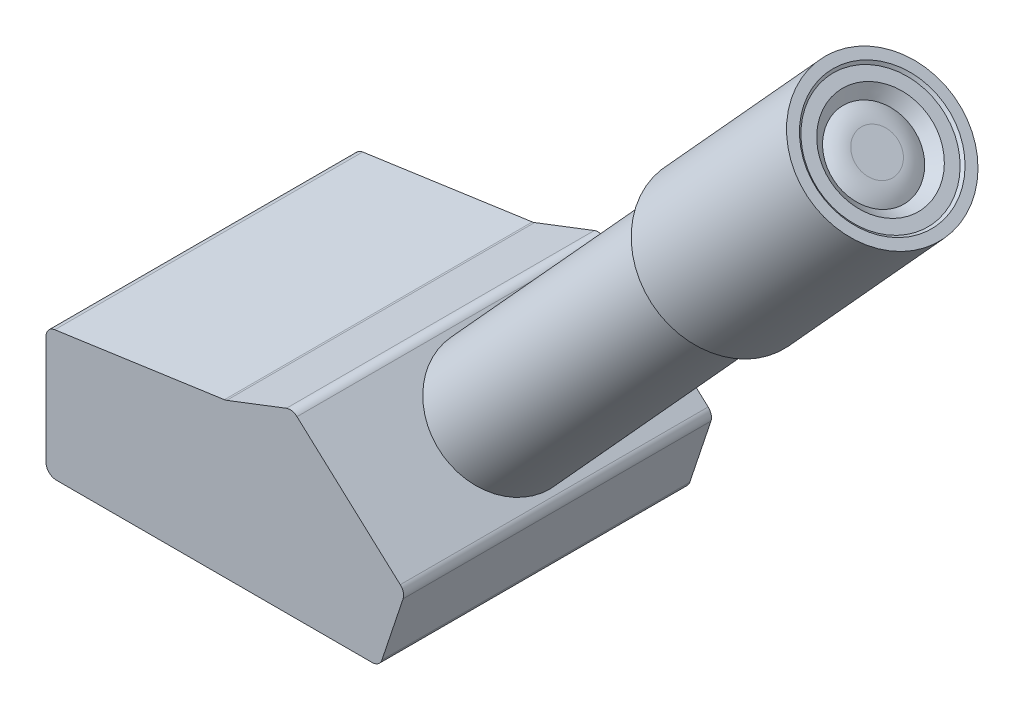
ISO-10303-21;
HEADER;
FILE_DESCRIPTION(('STEP AP214'),'2;1');
FILE_NAME('part.step','',(''),(''),'','','');
FILE_SCHEMA(('AUTOMOTIVE_DESIGN { 1 0 10303 214 1 1 1 1 }'));
ENDSEC;
DATA;
#1=APPLICATION_CONTEXT('core data for automotive mechanical design processes');
#2=APPLICATION_PROTOCOL_DEFINITION('international standard','automotive_design',2000,#1);
#3=PRODUCT_CONTEXT('',#1,'mechanical');
#4=PRODUCT('Part','Part','',(#3));
#5=PRODUCT_RELATED_PRODUCT_CATEGORY('part','',(#4));
#6=PRODUCT_DEFINITION_FORMATION('','',#4);
#7=PRODUCT_DEFINITION_CONTEXT('part definition',#1,'design');
#8=PRODUCT_DEFINITION('design','',#6,#7);
#9=PRODUCT_DEFINITION_SHAPE('','',#8);
#10=(LENGTH_UNIT() NAMED_UNIT(*) SI_UNIT(.MILLI.,.METRE.));
#11=(NAMED_UNIT(*) PLANE_ANGLE_UNIT() SI_UNIT($,.RADIAN.));
#12=(NAMED_UNIT(*) SI_UNIT($,.STERADIAN.) SOLID_ANGLE_UNIT());
#13=UNCERTAINTY_MEASURE_WITH_UNIT(LENGTH_MEASURE(1.E-05),#10,'distance_accuracy_value','');
#14=(GEOMETRIC_REPRESENTATION_CONTEXT(3) GLOBAL_UNCERTAINTY_ASSIGNED_CONTEXT((#13)) GLOBAL_UNIT_ASSIGNED_CONTEXT((#10,
#11,#12)) REPRESENTATION_CONTEXT('',''));
#15=CARTESIAN_POINT('',(0.,0.,0.));
#16=DIRECTION('',(0.,0.,1.));
#17=DIRECTION('',(1.,0.,0.));
#18=AXIS2_PLACEMENT_3D('',#15,#16,#17);
#19=CARTESIAN_POINT('',(2.00000000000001,0.,60.));
#20=DIRECTION('',(0.,1.,0.));
#21=DIRECTION('',(0.,0.,1.));
#22=AXIS2_PLACEMENT_3D('',#19,#20,#21);
#23=PLANE('',#22);
#24=DIRECTION('',(1.,0.,0.));
#25=VECTOR('',#24,1.);
#26=CARTESIAN_POINT('',(2.00000000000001,0.,0.));
#27=LINE('',#26,#25);
#28=CARTESIAN_POINT('',(2.00000000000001,0.,0.));
#29=VERTEX_POINT('',#28);
#30=CARTESIAN_POINT('',(63.5584815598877,0.,0.));
#31=VERTEX_POINT('',#30);
#32=EDGE_CURVE('E147',#29,#31,#27,.T.);
#33=ORIENTED_EDGE('',*,*,#32,.T.);
#34=DIRECTION('',(0.,0.,-1.));
#35=VECTOR('',#34,1.);
#36=CARTESIAN_POINT('',(63.5584815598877,0.,60.));
#37=LINE('',#36,#35);
#38=CARTESIAN_POINT('',(63.5584815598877,0.,60.));
#39=VERTEX_POINT('',#38);
#40=EDGE_CURVE('E208',#39,#31,#37,.T.);
#41=ORIENTED_EDGE('',*,*,#40,.F.);
#42=DIRECTION('',(1.,0.,0.));
#43=VECTOR('',#42,1.);
#44=CARTESIAN_POINT('',(2.00000000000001,0.,60.));
#45=LINE('',#44,#43);
#46=CARTESIAN_POINT('',(2.00000000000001,0.,60.));
#47=VERTEX_POINT('',#46);
#48=EDGE_CURVE('E170',#47,#39,#45,.T.);
#49=ORIENTED_EDGE('',*,*,#48,.F.);
#50=DIRECTION('',(0.,0.,-1.));
#51=VECTOR('',#50,1.);
#52=CARTESIAN_POINT('',(2.00000000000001,0.,60.));
#53=LINE('',#52,#51);
#54=EDGE_CURVE('E211',#47,#29,#53,.T.);
#55=ORIENTED_EDGE('',*,*,#54,.T.);
#56=EDGE_LOOP('',(#33,#41,#49,#55));
#57=FACE_BOUND('',#56,.T.);
#58=CARTESIAN_POINT('',(40.,0.,30.));
#59=DIRECTION('',(0.,1.,0.));
#60=DIRECTION('',(0.,0.,1.));
#61=AXIS2_PLACEMENT_3D('',#58,#59,#60);
#62=CIRCLE('',#61,10.);
#63=CARTESIAN_POINT('',(40.,0.,40.));
#64=VERTEX_POINT('',#63);
#65=EDGE_CURVE('E11',#64,#64,#62,.F.);
#66=ORIENTED_EDGE('',*,*,#65,.F.);
#67=EDGE_LOOP('',(#66));
#68=FACE_BOUND('',#67,.T.);
#69=ADVANCED_FACE('F27',(#57,#68),#23,.F.);
#70=CARTESIAN_POINT('',(69.0359910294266,15.8763717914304,60.));
#71=DIRECTION('',(-0.672672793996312,-0.739940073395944,0.));
#72=DIRECTION('',(0.739940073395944,-0.672672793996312,0.));
#73=AXIS2_PLACEMENT_3D('',#70,#71,#72);
#74=PLANE('',#73);
#75=DIRECTION('',(-0.739940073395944,0.672672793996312,0.));
#76=VECTOR('',#75,1.);
#77=CARTESIAN_POINT('',(69.0359910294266,15.8763717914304,0.));
#78=LINE('',#77,#76);
#79=CARTESIAN_POINT('',(69.0359910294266,15.8763717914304,0.));
#80=VERTEX_POINT('',#79);
#81=CARTESIAN_POINT('',(48.9124091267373,34.1705371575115,0.));
#82=VERTEX_POINT('',#81);
#83=EDGE_CURVE('E155',#80,#82,#78,.T.);
#84=ORIENTED_EDGE('',*,*,#83,.T.);
#85=DIRECTION('',(0.,0.,-1.));
#86=VECTOR('',#85,1.);
#87=CARTESIAN_POINT('',(48.9124091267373,34.1705371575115,60.));
#88=LINE('',#87,#86);
#89=CARTESIAN_POINT('',(48.9124091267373,34.1705371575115,60.));
#90=VERTEX_POINT('',#89);
#91=EDGE_CURVE('E196',#90,#82,#88,.T.);
#92=ORIENTED_EDGE('',*,*,#91,.F.);
#93=DIRECTION('',(-0.739940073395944,0.672672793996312,0.));
#94=VECTOR('',#93,1.);
#95=CARTESIAN_POINT('',(69.0359910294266,15.8763717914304,60.));
#96=LINE('',#95,#94);
#97=CARTESIAN_POINT('',(69.0359910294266,15.8763717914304,60.));
#98=VERTEX_POINT('',#97);
#99=EDGE_CURVE('E178',#98,#90,#96,.T.);
#100=ORIENTED_EDGE('',*,*,#99,.F.);
#101=DIRECTION('',(0.,0.,-1.));
#102=VECTOR('',#101,1.);
#103=CARTESIAN_POINT('',(69.0359910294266,15.8763717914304,60.));
#104=LINE('',#103,#102);
#105=EDGE_CURVE('E199',#98,#80,#104,.T.);
#106=ORIENTED_EDGE('',*,*,#105,.T.);
#107=EDGE_LOOP('',(#84,#92,#100,#106));
#108=FACE_BOUND('',#107,.T.);
#109=CARTESIAN_POINT('',(58.974200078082,25.023454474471,30.));
#110=DIRECTION('',(-0.672672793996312,-0.739940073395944,0.));
#111=DIRECTION('',(0.739940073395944,-0.672672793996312,0.));
#112=AXIS2_PLACEMENT_3D('',#109,#110,#111);
#113=CIRCLE('',#112,12.5);
#114=CARTESIAN_POINT('',(68.2234509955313,16.6150445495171,30.));
#115=VERTEX_POINT('',#114);
#116=EDGE_CURVE('E134',#115,#115,#113,.F.);
#117=ORIENTED_EDGE('',*,*,#116,.F.);
#118=EDGE_LOOP('',(#117));
#119=FACE_BOUND('',#118,.T.);
#120=ADVANCED_FACE('F237',(#108,#119),#74,.F.);
#121=CARTESIAN_POINT('',(2.,23.2654091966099,60.));
#122=DIRECTION('',(0.,0.,-1.));
#123=DIRECTION('',(-1.,0.,0.));
#124=AXIS2_PLACEMENT_3D('',#121,#122,#123);
#125=CYLINDRICAL_SURFACE('',#124,2.);
#126=CARTESIAN_POINT('',(2.,23.2654091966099,0.));
#127=DIRECTION('',(0.,0.,1.));
#128=DIRECTION('',(1.,0.,0.));
#129=AXIS2_PLACEMENT_3D('',#126,#127,#128);
#130=CIRCLE('',#129,2.);
#131=CARTESIAN_POINT('',(1.71715728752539,25.2453081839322,0.));
#132=VERTEX_POINT('',#131);
#133=CARTESIAN_POINT('',(0.,23.2654091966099,0.));
#134=VERTEX_POINT('',#133);
#135=EDGE_CURVE('E121',#132,#134,#130,.T.);
#136=ORIENTED_EDGE('',*,*,#135,.T.);
#137=DIRECTION('',(0.,0.,-1.));
#138=VECTOR('',#137,1.);
#139=CARTESIAN_POINT('',(0.,23.2654091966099,60.));
#140=LINE('',#139,#138);
#141=CARTESIAN_POINT('',(0.,23.2654091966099,60.));
#142=VERTEX_POINT('',#141);
#143=EDGE_CURVE('E129',#142,#134,#140,.T.);
#144=ORIENTED_EDGE('',*,*,#143,.F.);
#145=CARTESIAN_POINT('',(2.,23.2654091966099,60.));
#146=DIRECTION('',(0.,0.,1.));
#147=DIRECTION('',(1.,0.,0.));
#148=AXIS2_PLACEMENT_3D('',#145,#146,#147);
#149=CIRCLE('',#148,2.);
#150=CARTESIAN_POINT('',(1.71715728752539,25.2453081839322,60.));
#151=VERTEX_POINT('',#150);
#152=EDGE_CURVE('E165',#151,#142,#149,.T.);
#153=ORIENTED_EDGE('',*,*,#152,.F.);
#154=DIRECTION('',(0.,0.,-1.));
#155=VECTOR('',#154,1.);
#156=CARTESIAN_POINT('',(1.71715728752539,25.2453081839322,60.));
#157=LINE('',#156,#155);
#158=EDGE_CURVE('E138',#151,#132,#157,.T.);
#159=ORIENTED_EDGE('',*,*,#158,.T.);
#160=EDGE_LOOP('',(#136,#144,#153,#159));
#161=FACE_BOUND('',#160,.T.);
#162=ADVANCED_FACE('F29',(#161),#125,.T.);
#163=CARTESIAN_POINT('',(0.,2.00000000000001,60.));
#164=DIRECTION('',(1.,0.,0.));
#165=DIRECTION('',(0.,0.,-1.));
#166=AXIS2_PLACEMENT_3D('',#163,#164,#165);
#167=PLANE('',#166);
#168=DIRECTION('',(0.,-1.,0.));
#169=VECTOR('',#168,1.);
#170=CARTESIAN_POINT('',(0.,2.00000000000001,0.));
#171=LINE('',#170,#169);
#172=CARTESIAN_POINT('',(0.,2.00000000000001,0.));
#173=VERTEX_POINT('',#172);
#174=EDGE_CURVE('E116',#134,#173,#171,.T.);
#175=ORIENTED_EDGE('',*,*,#174,.T.);
#176=DIRECTION('',(0.,0.,-1.));
#177=VECTOR('',#176,1.);
#178=CARTESIAN_POINT('',(0.,2.00000000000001,60.));
#179=LINE('',#178,#177);
#180=CARTESIAN_POINT('',(0.,2.00000000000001,60.));
#181=VERTEX_POINT('',#180);
#182=EDGE_CURVE('E135',#181,#173,#179,.T.);
#183=ORIENTED_EDGE('',*,*,#182,.F.);
#184=DIRECTION('',(0.,-1.,0.));
#185=VECTOR('',#184,1.);
#186=CARTESIAN_POINT('',(0.,2.00000000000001,60.));
#187=LINE('',#186,#185);
#188=EDGE_CURVE('E131',#142,#181,#187,.T.);
#189=ORIENTED_EDGE('',*,*,#188,.F.);
#190=ORIENTED_EDGE('',*,*,#143,.T.);
#191=EDGE_LOOP('',(#175,#183,#189,#190));
#192=FACE_BOUND('',#191,.T.);
#193=ADVANCED_FACE('F130',(#192),#167,.F.);
#194=CARTESIAN_POINT('',(2.,2.,60.));
#195=DIRECTION('',(0.,0.,-1.));
#196=DIRECTION('',(-1.,0.,0.));
#197=AXIS2_PLACEMENT_3D('',#194,#195,#196);
#198=CYLINDRICAL_SURFACE('',#197,2.);
#199=CARTESIAN_POINT('',(2.,2.,0.));
#200=DIRECTION('',(0.,0.,1.));
#201=DIRECTION('',(1.,0.,0.));
#202=AXIS2_PLACEMENT_3D('',#199,#200,#201);
#203=CIRCLE('',#202,2.);
#204=EDGE_CURVE('E123',#173,#29,#203,.T.);
#205=ORIENTED_EDGE('',*,*,#204,.T.);
#206=ORIENTED_EDGE('',*,*,#54,.F.);
#207=CARTESIAN_POINT('',(2.,2.,60.));
#208=DIRECTION('',(0.,0.,1.));
#209=DIRECTION('',(1.,0.,0.));
#210=AXIS2_PLACEMENT_3D('',#207,#208,#209);
#211=CIRCLE('',#210,2.);
#212=EDGE_CURVE('E168',#181,#47,#211,.T.);
#213=ORIENTED_EDGE('',*,*,#212,.F.);
#214=ORIENTED_EDGE('',*,*,#182,.T.);
#215=EDGE_LOOP('',(#205,#206,#213,#214));
#216=FACE_BOUND('',#215,.T.);
#217=ADVANCED_FACE('F250',(#216),#198,.T.);
#218=CARTESIAN_POINT('',(63.5584815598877,2.,60.));
#219=DIRECTION('',(0.,0.,-1.));
#220=DIRECTION('',(-1.,0.,0.));
#221=AXIS2_PLACEMENT_3D('',#218,#219,#220);
#222=CYLINDRICAL_SURFACE('',#221,2.00000000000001);
#223=CARTESIAN_POINT('',(63.5584815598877,2.,0.));
#224=DIRECTION('',(0.,0.,1.));
#225=DIRECTION('',(1.,0.,0.));
#226=AXIS2_PLACEMENT_3D('',#223,#224,#225);
#227=CIRCLE('',#226,2.00000000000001);
#228=CARTESIAN_POINT('',(65.4558481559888,1.36754446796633,0.));
#229=VERTEX_POINT('',#228);
#230=EDGE_CURVE('E149',#31,#229,#227,.T.);
#231=ORIENTED_EDGE('',*,*,#230,.T.);
#232=DIRECTION('',(0.,0.,-1.));
#233=VECTOR('',#232,1.);
#234=CARTESIAN_POINT('',(65.4558481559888,1.36754446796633,60.));
#235=LINE('',#234,#233);
#236=CARTESIAN_POINT('',(65.4558481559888,1.36754446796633,60.));
#237=VERTEX_POINT('',#236);
#238=EDGE_CURVE('E205',#237,#229,#235,.T.);
#239=ORIENTED_EDGE('',*,*,#238,.F.);
#240=CARTESIAN_POINT('',(63.5584815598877,2.,60.));
#241=DIRECTION('',(0.,0.,1.));
#242=DIRECTION('',(1.,0.,0.));
#243=AXIS2_PLACEMENT_3D('',#240,#241,#242);
#244=CIRCLE('',#243,2.00000000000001);
#245=EDGE_CURVE('E172',#39,#237,#244,.T.);
#246=ORIENTED_EDGE('',*,*,#245,.F.);
#247=ORIENTED_EDGE('',*,*,#40,.T.);
#248=EDGE_LOOP('',(#231,#239,#246,#247));
#249=FACE_BOUND('',#248,.T.);
#250=ADVANCED_FACE('F248',(#249),#222,.T.);
#251=CARTESIAN_POINT('',(65.4558481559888,1.36754446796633,60.));
#252=DIRECTION('',(-0.948683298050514,0.316227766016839,0.));
#253=DIRECTION('',(-0.316227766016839,-0.948683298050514,0.));
#254=AXIS2_PLACEMENT_3D('',#251,#252,#253);
#255=PLANE('',#254);
#256=DIRECTION('',(0.316227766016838,0.948683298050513,0.));
#257=VECTOR('',#256,1.);
#258=CARTESIAN_POINT('',(65.4558481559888,1.36754446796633,0.));
#259=LINE('',#258,#257);
#260=CARTESIAN_POINT('',(69.588012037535,13.7640361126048,0.));
#261=VERTEX_POINT('',#260);
#262=EDGE_CURVE('E151',#229,#261,#259,.T.);
#263=ORIENTED_EDGE('',*,*,#262,.T.);
#264=DIRECTION('',(0.,0.,-1.));
#265=VECTOR('',#264,1.);
#266=CARTESIAN_POINT('',(69.588012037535,13.7640361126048,60.));
#267=LINE('',#266,#265);
#268=CARTESIAN_POINT('',(69.588012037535,13.7640361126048,60.));
#269=VERTEX_POINT('',#268);
#270=EDGE_CURVE('E202',#269,#261,#267,.T.);
#271=ORIENTED_EDGE('',*,*,#270,.F.);
#272=DIRECTION('',(0.316227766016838,0.948683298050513,0.));
#273=VECTOR('',#272,1.);
#274=CARTESIAN_POINT('',(65.4558481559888,1.36754446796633,60.));
#275=LINE('',#274,#273);
#276=EDGE_CURVE('E174',#237,#269,#275,.T.);
#277=ORIENTED_EDGE('',*,*,#276,.F.);
#278=ORIENTED_EDGE('',*,*,#238,.T.);
#279=EDGE_LOOP('',(#263,#271,#277,#278));
#280=FACE_BOUND('',#279,.T.);
#281=ADVANCED_FACE('F272',(#280),#255,.F.);
#282=CARTESIAN_POINT('',(67.6906454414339,14.3964916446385,60.));
#283=DIRECTION('',(0.,0.,-1.));
#284=DIRECTION('',(-1.,0.,0.));
#285=AXIS2_PLACEMENT_3D('',#282,#283,#284);
#286=CYLINDRICAL_SURFACE('',#285,2.);
#287=CARTESIAN_POINT('',(67.6906454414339,14.3964916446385,0.));
#288=DIRECTION('',(0.,0.,1.));
#289=DIRECTION('',(1.,0.,0.));
#290=AXIS2_PLACEMENT_3D('',#287,#288,#289);
#291=CIRCLE('',#290,2.);
#292=EDGE_CURVE('E153',#261,#80,#291,.T.);
#293=ORIENTED_EDGE('',*,*,#292,.T.);
#294=ORIENTED_EDGE('',*,*,#105,.F.);
#295=CARTESIAN_POINT('',(67.6906454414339,14.3964916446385,60.));
#296=DIRECTION('',(0.,0.,1.));
#297=DIRECTION('',(1.,0.,0.));
#298=AXIS2_PLACEMENT_3D('',#295,#296,#297);
#299=CIRCLE('',#298,2.);
#300=EDGE_CURVE('E176',#269,#98,#299,.T.);
#301=ORIENTED_EDGE('',*,*,#300,.F.);
#302=ORIENTED_EDGE('',*,*,#270,.T.);
#303=EDGE_LOOP('',(#293,#294,#301,#302));
#304=FACE_BOUND('',#303,.T.);
#305=ADVANCED_FACE('F279',(#304),#286,.T.);
#306=CARTESIAN_POINT('',(47.5670635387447,32.6906570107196,60.));
#307=DIRECTION('',(0.,0.,-1.));
#308=DIRECTION('',(-1.,0.,0.));
#309=AXIS2_PLACEMENT_3D('',#306,#307,#308);
#310=CYLINDRICAL_SURFACE('',#309,2.);
#311=CARTESIAN_POINT('',(47.5670635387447,32.6906570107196,0.));
#312=DIRECTION('',(0.,0.,1.));
#313=DIRECTION('',(1.,0.,0.));
#314=AXIS2_PLACEMENT_3D('',#311,#312,#313);
#315=CIRCLE('',#314,2.);
#316=CARTESIAN_POINT('',(46.849105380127,34.5573482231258,0.));
#317=VERTEX_POINT('',#316);
#318=EDGE_CURVE('E157',#82,#317,#315,.T.);
#319=ORIENTED_EDGE('',*,*,#318,.T.);
#320=DIRECTION('',(0.,0.,-1.));
#321=VECTOR('',#320,1.);
#322=CARTESIAN_POINT('',(46.849105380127,34.5573482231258,60.));
#323=LINE('',#322,#321);
#324=CARTESIAN_POINT('',(46.849105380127,34.5573482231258,60.));
#325=VERTEX_POINT('',#324);
#326=EDGE_CURVE('E193',#325,#317,#323,.T.);
#327=ORIENTED_EDGE('',*,*,#326,.F.);
#328=CARTESIAN_POINT('',(47.5670635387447,32.6906570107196,60.));
#329=DIRECTION('',(0.,0.,1.));
#330=DIRECTION('',(1.,0.,0.));
#331=AXIS2_PLACEMENT_3D('',#328,#329,#330);
#332=CIRCLE('',#331,2.);
#333=EDGE_CURVE('E180',#90,#325,#332,.T.);
#334=ORIENTED_EDGE('',*,*,#333,.F.);
#335=ORIENTED_EDGE('',*,*,#91,.T.);
#336=EDGE_LOOP('',(#319,#327,#334,#335));
#337=FACE_BOUND('',#336,.T.);
#338=ADVANCED_FACE('F286',(#337),#310,.T.);
#339=CARTESIAN_POINT('',(46.849105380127,34.5573482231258,60.));
#340=DIRECTION('',(0.35897907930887,-0.933345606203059,0.));
#341=DIRECTION('',(0.933345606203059,0.35897907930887,0.));
#342=AXIS2_PLACEMENT_3D('',#339,#340,#341);
#343=PLANE('',#342);
#344=DIRECTION('',(-0.933345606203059,-0.35897907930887,0.));
#345=VECTOR('',#344,1.);
#346=CARTESIAN_POINT('',(46.849105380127,34.5573482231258,0.));
#347=LINE('',#346,#345);
#348=CARTESIAN_POINT('',(35.2111548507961,30.0812134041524,0.));
#349=VERTEX_POINT('',#348);
#350=EDGE_CURVE('E159',#317,#349,#347,.T.);
#351=ORIENTED_EDGE('',*,*,#350,.T.);
#352=DIRECTION('',(0.,0.,-1.));
#353=VECTOR('',#352,1.);
#354=CARTESIAN_POINT('',(35.2111548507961,30.0812134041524,60.));
#355=LINE('',#354,#353);
#356=CARTESIAN_POINT('',(35.2111548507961,30.0812134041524,60.));
#357=VERTEX_POINT('',#356);
#358=EDGE_CURVE('E190',#357,#349,#355,.T.);
#359=ORIENTED_EDGE('',*,*,#358,.F.);
#360=DIRECTION('',(-0.933345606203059,-0.35897907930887,0.));
#361=VECTOR('',#360,1.);
#362=CARTESIAN_POINT('',(46.849105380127,34.5573482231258,60.));
#363=LINE('',#362,#361);
#364=EDGE_CURVE('E182',#325,#357,#363,.T.);
#365=ORIENTED_EDGE('',*,*,#364,.F.);
#366=ORIENTED_EDGE('',*,*,#326,.T.);
#367=EDGE_LOOP('',(#351,#359,#365,#366));
#368=FACE_BOUND('',#367,.T.);
#369=ADVANCED_FACE('F294',(#368),#343,.F.);
#370=CARTESIAN_POINT('',(34.4931966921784,31.9479046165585,60.));
#371=DIRECTION('',(0.,0.,-1.));
#372=DIRECTION('',(-1.,0.,0.));
#373=AXIS2_PLACEMENT_3D('',#370,#371,#372);
#374=CYLINDRICAL_SURFACE('',#373,2.);
#375=CARTESIAN_POINT('',(34.4931966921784,31.9479046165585,0.));
#376=DIRECTION('',(0.,0.,-1.));
#377=DIRECTION('',(-1.,0.,0.));
#378=AXIS2_PLACEMENT_3D('',#375,#376,#377);
#379=CIRCLE('',#378,2.);
#380=CARTESIAN_POINT('',(34.776039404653,29.9680056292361,0.));
#381=VERTEX_POINT('',#380);
#382=EDGE_CURVE('E161',#349,#381,#379,.T.);
#383=ORIENTED_EDGE('',*,*,#382,.T.);
#384=DIRECTION('',(0.,0.,-1.));
#385=VECTOR('',#384,1.);
#386=CARTESIAN_POINT('',(34.776039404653,29.9680056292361,60.));
#387=LINE('',#386,#385);
#388=CARTESIAN_POINT('',(34.776039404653,29.9680056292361,60.));
#389=VERTEX_POINT('',#388);
#390=EDGE_CURVE('E187',#389,#381,#387,.T.);
#391=ORIENTED_EDGE('',*,*,#390,.F.);
#392=CARTESIAN_POINT('',(34.4931966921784,31.9479046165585,60.));
#393=DIRECTION('',(0.,0.,-1.));
#394=DIRECTION('',(-1.,0.,0.));
#395=AXIS2_PLACEMENT_3D('',#392,#393,#394);
#396=CIRCLE('',#395,2.);
#397=EDGE_CURVE('E47',#357,#389,#396,.T.);
#398=ORIENTED_EDGE('',*,*,#397,.F.);
#399=ORIENTED_EDGE('',*,*,#358,.T.);
#400=EDGE_LOOP('',(#383,#391,#398,#399));
#401=FACE_BOUND('',#400,.T.);
#402=ADVANCED_FACE('F302',(#401),#374,.F.);
#403=CARTESIAN_POINT('',(34.776039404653,29.9680056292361,60.));
#404=DIRECTION('',(0.141421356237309,-0.989949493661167,0.));
#405=DIRECTION('',(0.989949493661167,0.141421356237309,0.));
#406=AXIS2_PLACEMENT_3D('',#403,#404,#405);
#407=PLANE('',#406);
#408=DIRECTION('',(-0.989949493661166,-0.141421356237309,0.));
#409=VECTOR('',#408,1.);
#410=CARTESIAN_POINT('',(34.776039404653,29.9680056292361,0.));
#411=LINE('',#410,#409);
#412=EDGE_CURVE('E163',#381,#132,#411,.T.);
#413=ORIENTED_EDGE('',*,*,#412,.T.);
#414=ORIENTED_EDGE('',*,*,#158,.F.);
#415=DIRECTION('',(-0.989949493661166,-0.141421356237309,0.));
#416=VECTOR('',#415,1.);
#417=CARTESIAN_POINT('',(34.776039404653,29.9680056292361,60.));
#418=LINE('',#417,#416);
#419=EDGE_CURVE('E42',#389,#151,#418,.T.);
#420=ORIENTED_EDGE('',*,*,#419,.F.);
#421=ORIENTED_EDGE('',*,*,#390,.T.);
#422=EDGE_LOOP('',(#413,#414,#420,#421));
#423=FACE_BOUND('',#422,.T.);
#424=ADVANCED_FACE('F310',(#423),#407,.F.);
#425=CARTESIAN_POINT('',(2.,23.2654091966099,60.));
#426=DIRECTION('',(0.,0.,1.));
#427=DIRECTION('',(1.,0.,0.));
#428=AXIS2_PLACEMENT_3D('',#425,#426,#427);
#429=PLANE('',#428);
#430=ORIENTED_EDGE('',*,*,#152,.T.);
#431=ORIENTED_EDGE('',*,*,#188,.T.);
#432=ORIENTED_EDGE('',*,*,#212,.T.);
#433=ORIENTED_EDGE('',*,*,#48,.T.);
#434=ORIENTED_EDGE('',*,*,#245,.T.);
#435=ORIENTED_EDGE('',*,*,#276,.T.);
#436=ORIENTED_EDGE('',*,*,#300,.T.);
#437=ORIENTED_EDGE('',*,*,#99,.T.);
#438=ORIENTED_EDGE('',*,*,#333,.T.);
#439=ORIENTED_EDGE('',*,*,#364,.T.);
#440=ORIENTED_EDGE('',*,*,#397,.T.);
#441=ORIENTED_EDGE('',*,*,#419,.T.);
#442=EDGE_LOOP('',(#430,#431,#432,#433,#434,#435,#436,#437,#438,#439,#440,#441));
#443=FACE_BOUND('',#442,.T.);
#444=ADVANCED_FACE('F318',(#443),#429,.T.);
#445=CARTESIAN_POINT('',(2.,23.2654091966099,0.));
#446=DIRECTION('',(0.,0.,1.));
#447=DIRECTION('',(1.,0.,0.));
#448=AXIS2_PLACEMENT_3D('',#445,#446,#447);
#449=PLANE('',#448);
#450=ORIENTED_EDGE('',*,*,#135,.F.);
#451=ORIENTED_EDGE('',*,*,#412,.F.);
#452=ORIENTED_EDGE('',*,*,#382,.F.);
#453=ORIENTED_EDGE('',*,*,#350,.F.);
#454=ORIENTED_EDGE('',*,*,#318,.F.);
#455=ORIENTED_EDGE('',*,*,#83,.F.);
#456=ORIENTED_EDGE('',*,*,#292,.F.);
#457=ORIENTED_EDGE('',*,*,#262,.F.);
#458=ORIENTED_EDGE('',*,*,#230,.F.);
#459=ORIENTED_EDGE('',*,*,#32,.F.);
#460=ORIENTED_EDGE('',*,*,#204,.F.);
#461=ORIENTED_EDGE('',*,*,#174,.F.);
#462=EDGE_LOOP('',(#450,#451,#452,#453,#454,#455,#456,#457,#458,#459,#460,#461));
#463=FACE_BOUND('',#462,.T.);
#464=ADVANCED_FACE('F118',(#463),#449,.F.);
#465=CARTESIAN_POINT('',(102.697931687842,73.1195592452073,30.));
#466=DIRECTION('',(-0.672672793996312,-0.739940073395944,0.));
#467=DIRECTION('',(0.739940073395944,-0.672672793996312,0.));
#468=AXIS2_PLACEMENT_3D('',#465,#466,#467);
#469=CYLINDRICAL_SURFACE('',#468,12.5);
#470=CARTESIAN_POINT('',(102.697931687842,73.1195592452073,30.));
#471=DIRECTION('',(0.672672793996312,0.739940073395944,0.));
#472=DIRECTION('',(-0.739940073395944,0.672672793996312,0.));
#473=AXIS2_PLACEMENT_3D('',#470,#471,#472);
#474=CIRCLE('',#473,12.5);
#475=CARTESIAN_POINT('',(93.448680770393,81.5279691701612,30.));
#476=VERTEX_POINT('',#475);
#477=EDGE_CURVE('E139',#476,#476,#474,.T.);
#478=ORIENTED_EDGE('',*,*,#477,.F.);
#479=EDGE_LOOP('',(#478));
#480=FACE_BOUND('',#479,.T.);
#481=ORIENTED_EDGE('',*,*,#116,.T.);
#482=EDGE_LOOP('',(#481));
#483=FACE_BOUND('',#482,.T.);
#484=ADVANCED_FACE('F332',(#480,#483),#469,.T.);
#485=CARTESIAN_POINT('',(102.697931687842,73.1195592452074,30.));
#486=DIRECTION('',(0.672672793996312,0.739940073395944,0.));
#487=DIRECTION('',(-0.739940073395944,0.672672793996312,0.));
#488=AXIS2_PLACEMENT_3D('',#485,#486,#487);
#489=PLANE('',#488);
#490=CARTESIAN_POINT('',(102.697931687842,73.1195592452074,30.));
#491=DIRECTION('',(0.672672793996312,0.739940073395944,0.));
#492=DIRECTION('',(-0.739940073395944,0.672672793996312,0.));
#493=AXIS2_PLACEMENT_3D('',#490,#491,#492);
#494=CIRCLE('',#493,15.);
#495=CARTESIAN_POINT('',(91.5988305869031,83.209651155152,30.));
#496=VERTEX_POINT('',#495);
#497=EDGE_CURVE('E427',#496,#496,#494,.T.);
#498=ORIENTED_EDGE('',*,*,#497,.F.);
#499=EDGE_LOOP('',(#498));
#500=FACE_BOUND('',#499,.T.);
#501=ORIENTED_EDGE('',*,*,#477,.T.);
#502=EDGE_LOOP('',(#501));
#503=FACE_BOUND('',#502,.T.);
#504=ADVANCED_FACE('F343',(#500,#503),#489,.F.);
#505=CARTESIAN_POINT('',(132.968207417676,106.416862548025,30.));
#506=DIRECTION('',(-0.672672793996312,-0.739940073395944,0.));
#507=DIRECTION('',(0.739940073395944,-0.672672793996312,0.));
#508=AXIS2_PLACEMENT_3D('',#505,#506,#507);
#509=CYLINDRICAL_SURFACE('',#508,15.);
#510=CARTESIAN_POINT('',(132.968207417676,106.416862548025,30.));
#511=DIRECTION('',(0.672672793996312,0.739940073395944,0.));
#512=DIRECTION('',(-0.739940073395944,0.672672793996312,0.));
#513=AXIS2_PLACEMENT_3D('',#510,#511,#512);
#514=CIRCLE('',#513,15.);
#515=CARTESIAN_POINT('',(121.869106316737,116.50695445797,30.));
#516=VERTEX_POINT('',#515);
#517=EDGE_CURVE('E142',#516,#516,#514,.T.);
#518=ORIENTED_EDGE('',*,*,#517,.F.);
#519=EDGE_LOOP('',(#518));
#520=FACE_BOUND('',#519,.T.);
#521=ORIENTED_EDGE('',*,*,#497,.T.);
#522=EDGE_LOOP('',(#521));
#523=FACE_BOUND('',#522,.T.);
#524=ADVANCED_FACE('F351',(#520,#523),#509,.T.);
#525=CARTESIAN_POINT('',(132.968207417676,106.416862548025,30.));
#526=DIRECTION('',(0.672672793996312,0.739940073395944,0.));
#527=DIRECTION('',(-0.739940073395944,0.672672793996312,0.));
#528=AXIS2_PLACEMENT_3D('',#525,#526,#527);
#529=PLANE('',#528);
#530=CARTESIAN_POINT('',(132.968207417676,106.416862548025,30.));
#531=DIRECTION('',(0.672672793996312,0.739940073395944,0.));
#532=DIRECTION('',(-0.739940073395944,0.672672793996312,0.));
#533=AXIS2_PLACEMENT_3D('',#530,#531,#532);
#534=CIRCLE('',#533,12.9728150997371);
#535=CARTESIAN_POINT('',(123.369101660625,115.143322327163,30.));
#536=VERTEX_POINT('',#535);
#537=EDGE_CURVE('E421',#536,#536,#534,.T.);
#538=ORIENTED_EDGE('',*,*,#537,.F.);
#539=EDGE_LOOP('',(#538));
#540=FACE_BOUND('',#539,.T.);
#541=ORIENTED_EDGE('',*,*,#517,.T.);
#542=EDGE_LOOP('',(#541));
#543=FACE_BOUND('',#542,.T.);
#544=ADVANCED_FACE('F359',(#540,#543),#529,.T.);
#545=CARTESIAN_POINT('',(132.968207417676,106.416862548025,30.));
#546=DIRECTION('',(0.672672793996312,0.739940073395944,0.));
#547=DIRECTION('',(-0.739940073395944,0.672672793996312,0.));
#548=AXIS2_PLACEMENT_3D('',#545,#546,#547);
#549=CONICAL_SURFACE('',#548,12.9728150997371,0.78539816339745);
#550=CARTESIAN_POINT('',(132.631871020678,106.046892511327,30.));
#551=DIRECTION('',(0.672672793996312,0.739940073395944,0.));
#552=DIRECTION('',(-0.739940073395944,0.672672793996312,0.));
#553=AXIS2_PLACEMENT_3D('',#550,#551,#552);
#554=CIRCLE('',#553,12.4728150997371);
#555=CARTESIAN_POINT('',(123.402735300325,114.437015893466,30.));
#556=VERTEX_POINT('',#555);
#557=EDGE_CURVE('E424',#556,#556,#554,.T.);
#558=ORIENTED_EDGE('',*,*,#557,.F.);
#559=EDGE_LOOP('',(#558));
#560=FACE_BOUND('',#559,.T.);
#561=ORIENTED_EDGE('',*,*,#537,.T.);
#562=EDGE_LOOP('',(#561));
#563=FACE_BOUND('',#562,.T.);
#564=ADVANCED_FACE('F367',(#560,#563),#549,.F.);
#565=CARTESIAN_POINT('',(132.631871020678,106.046892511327,30.));
#566=DIRECTION('',(0.672672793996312,0.739940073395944,0.));
#567=DIRECTION('',(-0.739940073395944,0.672672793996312,0.));
#568=AXIS2_PLACEMENT_3D('',#565,#566,#567);
#569=PLANE('',#568);
#570=CARTESIAN_POINT('',(132.631871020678,106.046892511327,30.));
#571=DIRECTION('',(0.672672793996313,0.739940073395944,0.));
#572=DIRECTION('',(-0.739940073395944,0.672672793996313,0.));
#573=AXIS2_PLACEMENT_3D('',#570,#571,#572);
#574=CIRCLE('',#573,10.);
#575=CARTESIAN_POINT('',(125.232470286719,112.77362045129,30.));
#576=VERTEX_POINT('',#575);
#577=EDGE_CURVE('E414',#576,#576,#574,.T.);
#578=ORIENTED_EDGE('',*,*,#577,.F.);
#579=EDGE_LOOP('',(#578));
#580=FACE_BOUND('',#579,.T.);
#581=ORIENTED_EDGE('',*,*,#557,.T.);
#582=EDGE_LOOP('',(#581));
#583=FACE_BOUND('',#582,.T.);
#584=ADVANCED_FACE('F375',(#580,#583),#569,.T.);
#585=CARTESIAN_POINT('',(132.631871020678,106.046892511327,30.));
#586=DIRECTION('',(0.672672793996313,0.739940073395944,0.));
#587=DIRECTION('',(-0.739940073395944,0.672672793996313,0.));
#588=AXIS2_PLACEMENT_3D('',#585,#586,#587);
#589=CONICAL_SURFACE('',#588,10.,0.78539816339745);
#590=CARTESIAN_POINT('',(131.286525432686,104.567012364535,30.));
#591=DIRECTION('',(0.672672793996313,0.739940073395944,0.));
#592=DIRECTION('',(-0.739940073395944,0.672672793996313,0.));
#593=AXIS2_PLACEMENT_3D('',#590,#591,#592);
#594=CIRCLE('',#593,8.);
#595=CARTESIAN_POINT('',(125.367004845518,109.948394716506,30.));
#596=VERTEX_POINT('',#595);
#597=EDGE_CURVE('E417',#596,#596,#594,.T.);
#598=ORIENTED_EDGE('',*,*,#597,.F.);
#599=EDGE_LOOP('',(#598));
#600=FACE_BOUND('',#599,.T.);
#601=ORIENTED_EDGE('',*,*,#577,.T.);
#602=EDGE_LOOP('',(#601));
#603=FACE_BOUND('',#602,.T.);
#604=ADVANCED_FACE('F234',(#600,#603),#589,.F.);
#605=CARTESIAN_POINT('',(131.959198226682,105.306952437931,30.));
#606=DIRECTION('',(0.672672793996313,0.739940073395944,0.));
#607=DIRECTION('',(-0.739940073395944,0.672672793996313,0.));
#608=AXIS2_PLACEMENT_3D('',#605,#606,#607);
#609=PLANE('',#608);
#610=CARTESIAN_POINT('',(131.959198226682,105.306952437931,30.));
#611=DIRECTION('',(0.672672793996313,0.739940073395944,0.));
#612=DIRECTION('',(-0.739940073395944,0.672672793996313,0.));
#613=AXIS2_PLACEMENT_3D('',#610,#611,#612);
#614=CIRCLE('',#613,4.12701665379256);
#615=CARTESIAN_POINT('',(128.905453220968,108.083084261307,30.));
#616=VERTEX_POINT('',#615);
#617=EDGE_CURVE('E35',#616,#616,#614,.T.);
#618=ORIENTED_EDGE('',*,*,#617,.T.);
#619=EDGE_LOOP('',(#618));
#620=FACE_BOUND('',#619,.T.);
#621=ADVANCED_FACE('F219',(#620),#609,.T.);
#622=CARTESIAN_POINT('',(126.577815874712,99.3874318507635,30.));
#623=DIRECTION('',(-0.672672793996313,-0.739940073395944,0.));
#624=DIRECTION('',(0.739940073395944,-0.672672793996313,0.));
#625=AXIS2_PLACEMENT_3D('',#622,#623,#624);
#626=DEGENERATE_TOROIDAL_SURFACE('',#625,4.12701665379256,8.,.T.);
#627=ORIENTED_EDGE('',*,*,#597,.T.);
#628=EDGE_LOOP('',(#627));
#629=FACE_BOUND('',#628,.T.);
#630=ORIENTED_EDGE('',*,*,#617,.F.);
#631=EDGE_LOOP('',(#630));
#632=FACE_BOUND('',#631,.T.);
#633=ADVANCED_FACE('F221',(#629,#632),#626,.T.);
#634=CARTESIAN_POINT('',(40.,-10.,30.));
#635=DIRECTION('',(0.,1.,0.));
#636=DIRECTION('',(0.,0.,1.));
#637=AXIS2_PLACEMENT_3D('',#634,#635,#636);
#638=CYLINDRICAL_SURFACE('',#637,10.);
#639=CARTESIAN_POINT('',(40.,-10.,30.));
#640=DIRECTION('',(0.,-1.,0.));
#641=DIRECTION('',(0.,0.,-1.));
#642=AXIS2_PLACEMENT_3D('',#639,#640,#641);
#643=CIRCLE('',#642,10.);
#644=CARTESIAN_POINT('',(40.,-10.,20.));
#645=VERTEX_POINT('',#644);
#646=EDGE_CURVE('E413',#645,#645,#643,.T.);
#647=ORIENTED_EDGE('',*,*,#646,.F.);
#648=EDGE_LOOP('',(#647));
#649=FACE_BOUND('',#648,.T.);
#650=ORIENTED_EDGE('',*,*,#65,.T.);
#651=EDGE_LOOP('',(#650));
#652=FACE_BOUND('',#651,.T.);
#653=ADVANCED_FACE('F223',(#649,#652),#638,.T.);
#654=CARTESIAN_POINT('',(40.,-10.,30.));
#655=DIRECTION('',(0.,-1.,0.));
#656=DIRECTION('',(0.,0.,-1.));
#657=AXIS2_PLACEMENT_3D('',#654,#655,#656);
#658=PLANE('',#657);
#659=ORIENTED_EDGE('',*,*,#646,.T.);
#660=EDGE_LOOP('',(#659));
#661=FACE_BOUND('',#660,.T.);
#662=ADVANCED_FACE('F231',(#661),#658,.T.);
#663=CLOSED_SHELL('',(#69,#120,#162,#193,#217,#250,#281,#305,#338,#369,#402,#424,#444,#464,#484,
#504,#524,#544,#564,#584,#604,#621,#633,#653,#662));
#664=MANIFOLD_SOLID_BREP('B2',#663);
#665=ADVANCED_BREP_SHAPE_REPRESENTATION('',(#18,#664),#14);
#666=SHAPE_DEFINITION_REPRESENTATION(#9,#665);
ENDSEC;
END-ISO-10303-21;
